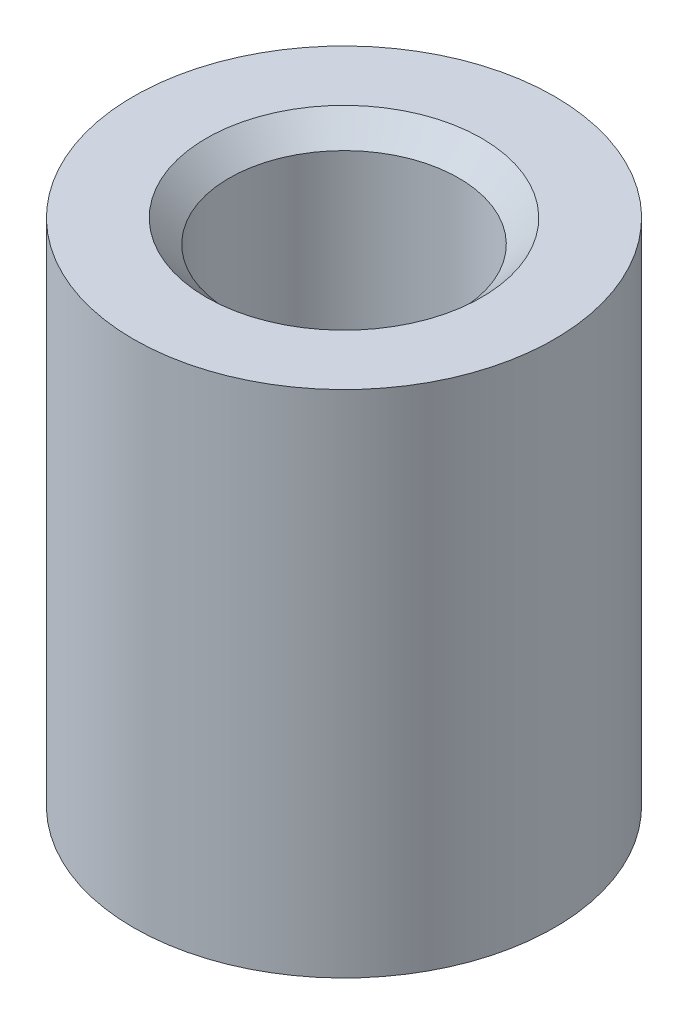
ISO-10303-21;
HEADER;
FILE_DESCRIPTION(('STEP AP214'),'2;1');
FILE_NAME('part.step','',(''),(''),'','','');
FILE_SCHEMA(('AUTOMOTIVE_DESIGN { 1 0 10303 214 1 1 1 1 }'));
ENDSEC;
DATA;
#1=APPLICATION_CONTEXT('core data for automotive mechanical design processes');
#2=APPLICATION_PROTOCOL_DEFINITION('international standard','automotive_design',2000,#1);
#3=PRODUCT_CONTEXT('',#1,'mechanical');
#4=PRODUCT('Part','Part','',(#3));
#5=PRODUCT_RELATED_PRODUCT_CATEGORY('part','',(#4));
#6=PRODUCT_DEFINITION_FORMATION('','',#4);
#7=PRODUCT_DEFINITION_CONTEXT('part definition',#1,'design');
#8=PRODUCT_DEFINITION('design','',#6,#7);
#9=PRODUCT_DEFINITION_SHAPE('','',#8);
#10=(LENGTH_UNIT() NAMED_UNIT(*) SI_UNIT(.MILLI.,.METRE.));
#11=(NAMED_UNIT(*) PLANE_ANGLE_UNIT() SI_UNIT($,.RADIAN.));
#12=(NAMED_UNIT(*) SI_UNIT($,.STERADIAN.) SOLID_ANGLE_UNIT());
#13=UNCERTAINTY_MEASURE_WITH_UNIT(LENGTH_MEASURE(1.E-05),#10,'distance_accuracy_value','');
#14=(GEOMETRIC_REPRESENTATION_CONTEXT(3) GLOBAL_UNCERTAINTY_ASSIGNED_CONTEXT((#13)) GLOBAL_UNIT_ASSIGNED_CONTEXT((#10,
#11,#12)) REPRESENTATION_CONTEXT('',''));
#15=CARTESIAN_POINT('',(0.,0.,0.));
#16=DIRECTION('',(0.,0.,1.));
#17=DIRECTION('',(1.,0.,0.));
#18=AXIS2_PLACEMENT_3D('',#15,#16,#17);
#19=CARTESIAN_POINT('',(0.,16.9164,0.));
#20=DIRECTION('',(0.,1.,0.));
#21=DIRECTION('',(0.,0.,1.));
#22=AXIS2_PLACEMENT_3D('',#19,#20,#21);
#23=PLANE('',#22);
#24=CARTESIAN_POINT('',(0.,16.9164,0.));
#25=DIRECTION('',(0.,1.,0.));
#26=DIRECTION('',(0.,0.,1.));
#27=AXIS2_PLACEMENT_3D('',#24,#25,#26);
#28=CIRCLE('',#27,4.572);
#29=CARTESIAN_POINT('',(0.,16.9164,4.572));
#30=VERTEX_POINT('',#29);
#31=EDGE_CURVE('E10',#30,#30,#28,.F.);
#32=ORIENTED_EDGE('',*,*,#31,.T.);
#33=EDGE_LOOP('',(#32));
#34=FACE_BOUND('',#33,.T.);
#35=CARTESIAN_POINT('',(0.,16.9164,0.));
#36=DIRECTION('',(0.,1.,0.));
#37=DIRECTION('',(0.,0.,1.));
#38=AXIS2_PLACEMENT_3D('',#35,#36,#37);
#39=CIRCLE('',#38,6.985);
#40=CARTESIAN_POINT('',(0.,16.9164,6.985));
#41=VERTEX_POINT('',#40);
#42=EDGE_CURVE('E51',#41,#41,#39,.T.);
#43=ORIENTED_EDGE('',*,*,#42,.T.);
#44=EDGE_LOOP('',(#43));
#45=FACE_BOUND('',#44,.T.);
#46=ADVANCED_FACE('F31',(#34,#45),#23,.T.);
#47=CARTESIAN_POINT('',(0.,0.,0.));
#48=DIRECTION('',(0.,1.,0.));
#49=DIRECTION('',(0.,0.,1.));
#50=AXIS2_PLACEMENT_3D('',#47,#48,#49);
#51=PLANE('',#50);
#52=CARTESIAN_POINT('',(0.,0.,0.));
#53=DIRECTION('',(0.,1.,0.));
#54=DIRECTION('',(0.,0.,1.));
#55=AXIS2_PLACEMENT_3D('',#52,#53,#54);
#56=CIRCLE('',#55,4.572);
#57=CARTESIAN_POINT('',(0.,0.,4.572));
#58=VERTEX_POINT('',#57);
#59=EDGE_CURVE('E46',#58,#58,#56,.T.);
#60=ORIENTED_EDGE('',*,*,#59,.T.);
#61=EDGE_LOOP('',(#60));
#62=FACE_BOUND('',#61,.T.);
#63=CARTESIAN_POINT('',(0.,0.,0.));
#64=DIRECTION('',(0.,1.,0.));
#65=DIRECTION('',(0.,0.,1.));
#66=AXIS2_PLACEMENT_3D('',#63,#64,#65);
#67=CIRCLE('',#66,6.985);
#68=CARTESIAN_POINT('',(0.,0.,6.985));
#69=VERTEX_POINT('',#68);
#70=EDGE_CURVE('E52',#69,#69,#67,.T.);
#71=ORIENTED_EDGE('',*,*,#70,.F.);
#72=EDGE_LOOP('',(#71));
#73=FACE_BOUND('',#72,.T.);
#74=ADVANCED_FACE('F63',(#62,#73),#51,.F.);
#75=CARTESIAN_POINT('',(0.,16.9164,0.));
#76=DIRECTION('',(0.,-1.,0.));
#77=DIRECTION('',(0.,0.,-1.));
#78=AXIS2_PLACEMENT_3D('',#75,#76,#77);
#79=CYLINDRICAL_SURFACE('',#78,6.985);
#80=ORIENTED_EDGE('',*,*,#42,.F.);
#81=EDGE_LOOP('',(#80));
#82=FACE_BOUND('',#81,.T.);
#83=ORIENTED_EDGE('',*,*,#70,.T.);
#84=EDGE_LOOP('',(#83));
#85=FACE_BOUND('',#84,.T.);
#86=ADVANCED_FACE('F59',(#82,#85),#79,.T.);
#87=CARTESIAN_POINT('',(0.,16.9164,0.));
#88=DIRECTION('',(0.,-1.,0.));
#89=DIRECTION('',(0.,0.,-1.));
#90=AXIS2_PLACEMENT_3D('',#87,#88,#89);
#91=CYLINDRICAL_SURFACE('',#90,3.81);
#92=CARTESIAN_POINT('',(0.,0.761999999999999,0.));
#93=DIRECTION('',(0.,1.,0.));
#94=DIRECTION('',(0.,0.,1.));
#95=AXIS2_PLACEMENT_3D('',#92,#93,#94);
#96=CIRCLE('',#95,3.81);
#97=CARTESIAN_POINT('',(0.,0.761999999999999,3.81));
#98=VERTEX_POINT('',#97);
#99=EDGE_CURVE('E38',#98,#98,#96,.F.);
#100=ORIENTED_EDGE('',*,*,#99,.T.);
#101=EDGE_LOOP('',(#100));
#102=FACE_BOUND('',#101,.T.);
#103=CARTESIAN_POINT('',(0.,16.1544,0.));
#104=DIRECTION('',(0.,1.,0.));
#105=DIRECTION('',(0.,0.,1.));
#106=AXIS2_PLACEMENT_3D('',#103,#104,#105);
#107=CIRCLE('',#106,3.81);
#108=CARTESIAN_POINT('',(0.,16.1544,3.81));
#109=VERTEX_POINT('',#108);
#110=EDGE_CURVE('E42',#109,#109,#107,.T.);
#111=ORIENTED_EDGE('',*,*,#110,.T.);
#112=EDGE_LOOP('',(#111));
#113=FACE_BOUND('',#112,.T.);
#114=ADVANCED_FACE('F62',(#102,#113),#91,.F.);
#115=CARTESIAN_POINT('',(0.,0.,0.));
#116=DIRECTION('',(0.,-1.,0.));
#117=DIRECTION('',(0.,0.,-1.));
#118=AXIS2_PLACEMENT_3D('',#115,#116,#117);
#119=CONICAL_SURFACE('',#118,4.572,0.785398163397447);
#120=ORIENTED_EDGE('',*,*,#99,.F.);
#121=EDGE_LOOP('',(#120));
#122=FACE_BOUND('',#121,.T.);
#123=ORIENTED_EDGE('',*,*,#59,.F.);
#124=EDGE_LOOP('',(#123));
#125=FACE_BOUND('',#124,.T.);
#126=ADVANCED_FACE('F75',(#122,#125),#119,.F.);
#127=CARTESIAN_POINT('',(0.,16.1544,0.));
#128=DIRECTION('',(0.,1.,0.));
#129=DIRECTION('',(0.,0.,1.));
#130=AXIS2_PLACEMENT_3D('',#127,#128,#129);
#131=CONICAL_SURFACE('',#130,3.81,0.785398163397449);
#132=ORIENTED_EDGE('',*,*,#31,.F.);
#133=EDGE_LOOP('',(#132));
#134=FACE_BOUND('',#133,.T.);
#135=ORIENTED_EDGE('',*,*,#110,.F.);
#136=EDGE_LOOP('',(#135));
#137=FACE_BOUND('',#136,.T.);
#138=ADVANCED_FACE('F33',(#134,#137),#131,.F.);
#139=CLOSED_SHELL('',(#46,#74,#86,#114,#126,#138));
#140=MANIFOLD_SOLID_BREP('B2',#139);
#141=ADVANCED_BREP_SHAPE_REPRESENTATION('',(#18,#140),#14);
#142=SHAPE_DEFINITION_REPRESENTATION(#9,#141);
ENDSEC;
END-ISO-10303-21;
